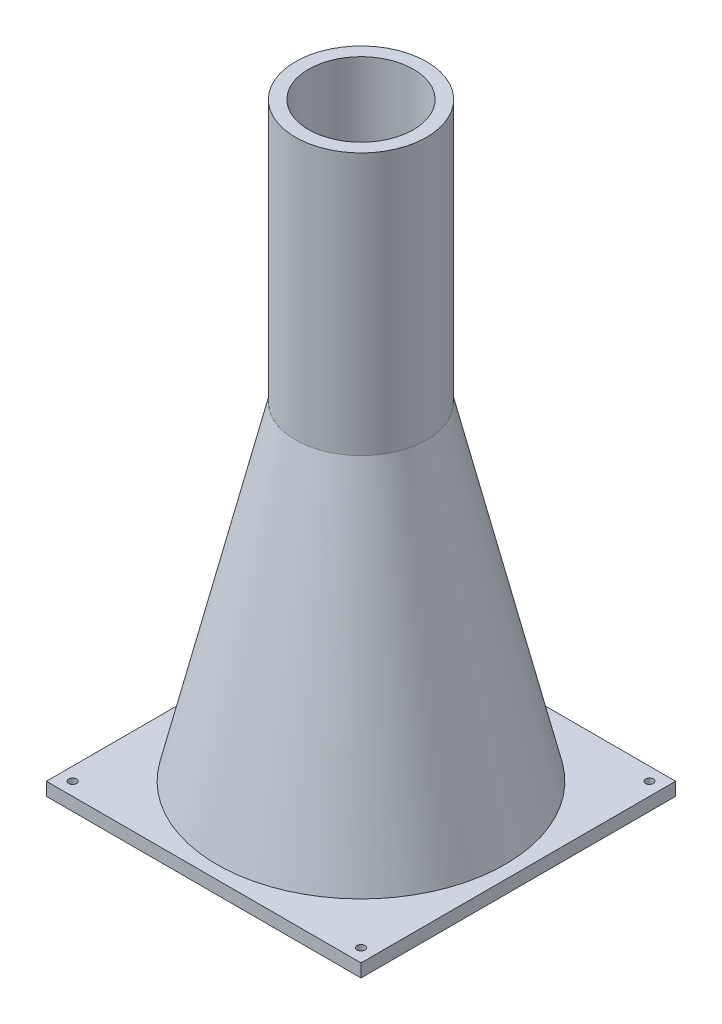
from build123d import *

# Parameters (mm, degrees)
CROQUIS2_W              = 120
CROQUIS2_H              = 120
SALIENTE_EXTRUIR1_DEPTH = 5
CROQUIS3_R              = 1.5
CORTAR_EXTRUIR1_DEPTH   = 5
CROQUIS4_R              = 50
CORTAR_EXTRUIR2_DEPTH   = 5


with BuildPart() as part:
    # Croquis1 → Revoluci_n1 (revolve)
    with BuildSketch(Plane.XY, mode=Mode.PRIVATE) as revoluci_n1_sk:
        Polygon((-25, 225.212863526), (-25, 125.212863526), (-55, 0), (-50, 0), (-20, 125.212863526), (-20, 225.212863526), align=None)
    revolve(revoluci_n1_sk.sketch.rotate(Axis((0, 0, 0), (0, 1, 0)), 270), axis=Axis((0, 0, 0), (0, 1, 0)))

    # Croquis2 → Saliente-Extruir1 (add)
    with BuildSketch(Plane.XZ):
        Rectangle(CROQUIS2_W, CROQUIS2_H)
    extrude(amount=SALIENTE_EXTRUIR1_DEPTH)

    # Croquis3 → Cortar-Extruir1 (cut)
    with BuildSketch(Plane.XZ.offset(5)):
        with Locations(Location((-55, 55, 0), (0, 0, 270))):
            Circle(CROQUIS3_R)
        with Locations(Location((55, 55, 0), (0, 0, 270))):
            Circle(CROQUIS3_R)
        with Locations(Location((55, -55, 0), (0, 0, 270))):
            Circle(CROQUIS3_R)
        with Locations(Location((-55, -55, 0), (0, 0, 270))):
            Circle(CROQUIS3_R)
    extrude(amount=-CORTAR_EXTRUIR1_DEPTH, mode=Mode.SUBTRACT)

    # Croquis4 → Cortar-Extruir2 (cut)
    with BuildSketch(Plane(origin=(0, 0, 0), x_dir=(1, 0, 0), z_dir=(0, 1, 0))):
        with Locations(Location((0, 0, 0), (0, 0, 270))):
            Circle(CROQUIS4_R)
    extrude(amount=-CORTAR_EXTRUIR2_DEPTH, mode=Mode.SUBTRACT)


solid = part.part
